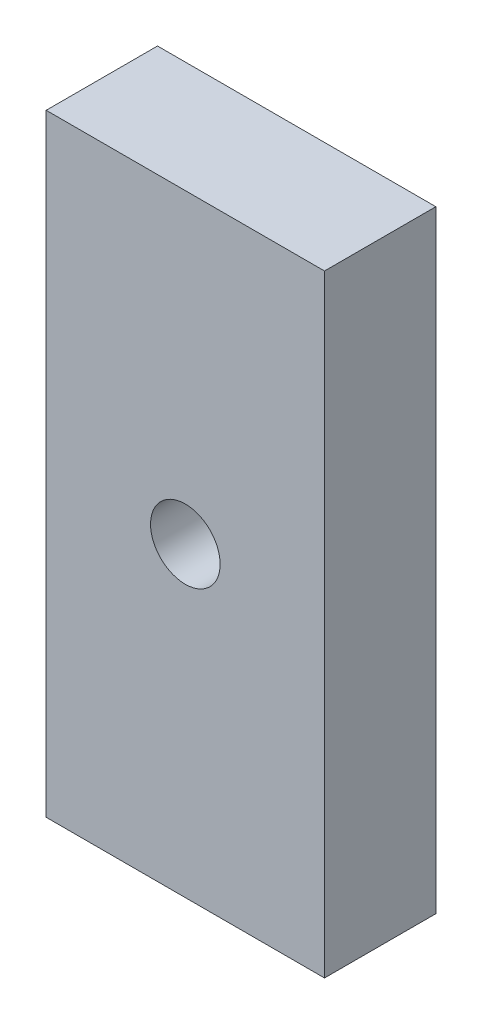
ISO-10303-21;
HEADER;
FILE_DESCRIPTION(('STEP AP214'),'2;1');
FILE_NAME('part.step','',(''),(''),'','','');
FILE_SCHEMA(('AUTOMOTIVE_DESIGN { 1 0 10303 214 1 1 1 1 }'));
ENDSEC;
DATA;
#1=APPLICATION_CONTEXT('core data for automotive mechanical design processes');
#2=APPLICATION_PROTOCOL_DEFINITION('international standard','automotive_design',2000,#1);
#3=PRODUCT_CONTEXT('',#1,'mechanical');
#4=PRODUCT('Part','Part','',(#3));
#5=PRODUCT_RELATED_PRODUCT_CATEGORY('part','',(#4));
#6=PRODUCT_DEFINITION_FORMATION('','',#4);
#7=PRODUCT_DEFINITION_CONTEXT('part definition',#1,'design');
#8=PRODUCT_DEFINITION('design','',#6,#7);
#9=PRODUCT_DEFINITION_SHAPE('','',#8);
#10=(LENGTH_UNIT() NAMED_UNIT(*) SI_UNIT(.MILLI.,.METRE.));
#11=(NAMED_UNIT(*) PLANE_ANGLE_UNIT() SI_UNIT($,.RADIAN.));
#12=(NAMED_UNIT(*) SI_UNIT($,.STERADIAN.) SOLID_ANGLE_UNIT());
#13=UNCERTAINTY_MEASURE_WITH_UNIT(LENGTH_MEASURE(1.E-05),#10,'distance_accuracy_value','');
#14=(GEOMETRIC_REPRESENTATION_CONTEXT(3) GLOBAL_UNCERTAINTY_ASSIGNED_CONTEXT((#13)) GLOBAL_UNIT_ASSIGNED_CONTEXT((#10,
#11,#12)) REPRESENTATION_CONTEXT('',''));
#15=CARTESIAN_POINT('',(0.,0.,0.));
#16=DIRECTION('',(0.,0.,1.));
#17=DIRECTION('',(1.,0.,0.));
#18=AXIS2_PLACEMENT_3D('',#15,#16,#17);
#19=CARTESIAN_POINT('',(0.,0.,0.));
#20=DIRECTION('',(0.,0.,1.));
#21=DIRECTION('',(0.,-1.,0.));
#22=AXIS2_PLACEMENT_3D('',#19,#20,#21);
#23=PLANE('',#22);
#24=CARTESIAN_POINT('',(0.,0.,0.));
#25=DIRECTION('',(0.,0.,1.));
#26=DIRECTION('',(0.,-1.,0.));
#27=AXIS2_PLACEMENT_3D('',#24,#25,#26);
#28=CIRCLE('',#27,2.5);
#29=CARTESIAN_POINT('',(0.,-2.5,0.));
#30=VERTEX_POINT('',#29);
#31=EDGE_CURVE('E68',#30,#30,#28,.T.);
#32=ORIENTED_EDGE('',*,*,#31,.T.);
#33=EDGE_LOOP('',(#32));
#34=FACE_BOUND('',#33,.T.);
#35=DIRECTION('',(1.,0.,0.));
#36=VECTOR('',#35,1.);
#37=CARTESIAN_POINT('',(-10.,22.,0.));
#38=LINE('',#37,#36);
#39=CARTESIAN_POINT('',(10.,22.,0.));
#40=VERTEX_POINT('',#39);
#41=CARTESIAN_POINT('',(-10.,22.,0.));
#42=VERTEX_POINT('',#41);
#43=EDGE_CURVE('E18',#40,#42,#38,.F.);
#44=ORIENTED_EDGE('',*,*,#43,.F.);
#45=DIRECTION('',(0.,-1.,0.));
#46=VECTOR('',#45,1.);
#47=CARTESIAN_POINT('',(10.,22.,0.));
#48=LINE('',#47,#46);
#49=CARTESIAN_POINT('',(10.,-22.,0.));
#50=VERTEX_POINT('',#49);
#51=EDGE_CURVE('E87',#50,#40,#48,.F.);
#52=ORIENTED_EDGE('',*,*,#51,.F.);
#53=DIRECTION('',(1.,0.,0.));
#54=VECTOR('',#53,1.);
#55=CARTESIAN_POINT('',(10.,-22.,0.));
#56=LINE('',#55,#54);
#57=CARTESIAN_POINT('',(-10.,-22.,0.));
#58=VERTEX_POINT('',#57);
#59=EDGE_CURVE('E69',#58,#50,#56,.T.);
#60=ORIENTED_EDGE('',*,*,#59,.F.);
#61=DIRECTION('',(0.,-1.,0.));
#62=VECTOR('',#61,1.);
#63=CARTESIAN_POINT('',(-10.,-22.,0.));
#64=LINE('',#63,#62);
#65=EDGE_CURVE('E54',#42,#58,#64,.T.);
#66=ORIENTED_EDGE('',*,*,#65,.F.);
#67=EDGE_LOOP('',(#44,#52,#60,#66));
#68=FACE_BOUND('',#67,.T.);
#69=ADVANCED_FACE('F15',(#34,#68),#23,.F.);
#70=CARTESIAN_POINT('',(-10.,22.,0.));
#71=DIRECTION('',(0.,1.,0.));
#72=DIRECTION('',(0.,0.,1.));
#73=AXIS2_PLACEMENT_3D('',#70,#71,#72);
#74=PLANE('',#73);
#75=ORIENTED_EDGE('',*,*,#43,.T.);
#76=DIRECTION('',(0.,0.,-1.));
#77=VECTOR('',#76,1.);
#78=CARTESIAN_POINT('',(-10.,22.,0.));
#79=LINE('',#78,#77);
#80=CARTESIAN_POINT('',(-10.,22.,8.));
#81=VERTEX_POINT('',#80);
#82=EDGE_CURVE('E60',#81,#42,#79,.T.);
#83=ORIENTED_EDGE('',*,*,#82,.F.);
#84=DIRECTION('',(1.,0.,0.));
#85=VECTOR('',#84,1.);
#86=CARTESIAN_POINT('',(0.,22.,8.));
#87=LINE('',#86,#85);
#88=CARTESIAN_POINT('',(10.,22.,8.));
#89=VERTEX_POINT('',#88);
#90=EDGE_CURVE('E92',#89,#81,#87,.F.);
#91=ORIENTED_EDGE('',*,*,#90,.F.);
#92=DIRECTION('',(0.,0.,1.));
#93=VECTOR('',#92,1.);
#94=CARTESIAN_POINT('',(10.,22.,0.));
#95=LINE('',#94,#93);
#96=EDGE_CURVE('E63',#40,#89,#95,.T.);
#97=ORIENTED_EDGE('',*,*,#96,.F.);
#98=EDGE_LOOP('',(#75,#83,#91,#97));
#99=FACE_BOUND('',#98,.T.);
#100=ADVANCED_FACE('F59',(#99),#74,.T.);
#101=CARTESIAN_POINT('',(-10.,-22.,0.));
#102=DIRECTION('',(-1.,0.,0.));
#103=DIRECTION('',(0.,0.,-1.));
#104=AXIS2_PLACEMENT_3D('',#101,#102,#103);
#105=PLANE('',#104);
#106=ORIENTED_EDGE('',*,*,#65,.T.);
#107=DIRECTION('',(0.,0.,-1.));
#108=VECTOR('',#107,1.);
#109=CARTESIAN_POINT('',(-10.,-22.,0.));
#110=LINE('',#109,#108);
#111=CARTESIAN_POINT('',(-10.,-22.,8.));
#112=VERTEX_POINT('',#111);
#113=EDGE_CURVE('E72',#112,#58,#110,.T.);
#114=ORIENTED_EDGE('',*,*,#113,.F.);
#115=DIRECTION('',(0.,-1.,0.));
#116=VECTOR('',#115,1.);
#117=CARTESIAN_POINT('',(-10.,0.,8.));
#118=LINE('',#117,#116);
#119=EDGE_CURVE('E76',#81,#112,#118,.T.);
#120=ORIENTED_EDGE('',*,*,#119,.F.);
#121=ORIENTED_EDGE('',*,*,#82,.T.);
#122=EDGE_LOOP('',(#106,#114,#120,#121));
#123=FACE_BOUND('',#122,.T.);
#124=ADVANCED_FACE('F74',(#123),#105,.T.);
#125=CARTESIAN_POINT('',(10.,-22.,0.));
#126=DIRECTION('',(0.,-1.,0.));
#127=DIRECTION('',(0.,0.,-1.));
#128=AXIS2_PLACEMENT_3D('',#125,#126,#127);
#129=PLANE('',#128);
#130=ORIENTED_EDGE('',*,*,#59,.T.);
#131=DIRECTION('',(0.,0.,1.));
#132=VECTOR('',#131,1.);
#133=CARTESIAN_POINT('',(10.,-22.,0.));
#134=LINE('',#133,#132);
#135=CARTESIAN_POINT('',(10.,-22.,8.));
#136=VERTEX_POINT('',#135);
#137=EDGE_CURVE('E34',#136,#50,#134,.F.);
#138=ORIENTED_EDGE('',*,*,#137,.F.);
#139=DIRECTION('',(1.,0.,0.));
#140=VECTOR('',#139,1.);
#141=CARTESIAN_POINT('',(0.,-22.,8.));
#142=LINE('',#141,#140);
#143=EDGE_CURVE('E25',#112,#136,#142,.T.);
#144=ORIENTED_EDGE('',*,*,#143,.F.);
#145=ORIENTED_EDGE('',*,*,#113,.T.);
#146=EDGE_LOOP('',(#130,#138,#144,#145));
#147=FACE_BOUND('',#146,.T.);
#148=ADVANCED_FACE('F120',(#147),#129,.T.);
#149=CARTESIAN_POINT('',(10.,22.,0.));
#150=DIRECTION('',(1.,0.,0.));
#151=DIRECTION('',(0.,0.,1.));
#152=AXIS2_PLACEMENT_3D('',#149,#150,#151);
#153=PLANE('',#152);
#154=ORIENTED_EDGE('',*,*,#51,.T.);
#155=ORIENTED_EDGE('',*,*,#96,.T.);
#156=DIRECTION('',(0.,-1.,0.));
#157=VECTOR('',#156,1.);
#158=CARTESIAN_POINT('',(10.,0.,8.));
#159=LINE('',#158,#157);
#160=EDGE_CURVE('E9',#136,#89,#159,.F.);
#161=ORIENTED_EDGE('',*,*,#160,.F.);
#162=ORIENTED_EDGE('',*,*,#137,.T.);
#163=EDGE_LOOP('',(#154,#155,#161,#162));
#164=FACE_BOUND('',#163,.T.);
#165=ADVANCED_FACE('F118',(#164),#153,.T.);
#166=CARTESIAN_POINT('',(0.,0.,8.));
#167=DIRECTION('',(0.,0.,1.));
#168=DIRECTION('',(0.,-1.,0.));
#169=AXIS2_PLACEMENT_3D('',#166,#167,#168);
#170=PLANE('',#169);
#171=CARTESIAN_POINT('',(0.,0.,8.));
#172=DIRECTION('',(0.,0.,1.));
#173=DIRECTION('',(0.,-1.,0.));
#174=AXIS2_PLACEMENT_3D('',#171,#172,#173);
#175=CIRCLE('',#174,2.5);
#176=CARTESIAN_POINT('',(0.,-2.5,8.));
#177=VERTEX_POINT('',#176);
#178=EDGE_CURVE('E100',#177,#177,#175,.T.);
#179=ORIENTED_EDGE('',*,*,#178,.F.);
#180=EDGE_LOOP('',(#179));
#181=FACE_BOUND('',#180,.T.);
#182=ORIENTED_EDGE('',*,*,#143,.T.);
#183=ORIENTED_EDGE('',*,*,#160,.T.);
#184=ORIENTED_EDGE('',*,*,#90,.T.);
#185=ORIENTED_EDGE('',*,*,#119,.T.);
#186=EDGE_LOOP('',(#182,#183,#184,#185));
#187=FACE_BOUND('',#186,.T.);
#188=ADVANCED_FACE('F112',(#181,#187),#170,.T.);
#189=CARTESIAN_POINT('',(0.,0.,0.));
#190=DIRECTION('',(0.,0.,1.));
#191=DIRECTION('',(0.,-1.,0.));
#192=AXIS2_PLACEMENT_3D('',#189,#190,#191);
#193=CYLINDRICAL_SURFACE('',#192,2.5);
#194=ORIENTED_EDGE('',*,*,#31,.F.);
#195=EDGE_LOOP('',(#194));
#196=FACE_BOUND('',#195,.T.);
#197=ORIENTED_EDGE('',*,*,#178,.T.);
#198=EDGE_LOOP('',(#197));
#199=FACE_BOUND('',#198,.T.);
#200=ADVANCED_FACE('F109',(#196,#199),#193,.F.);
#201=CLOSED_SHELL('',(#69,#100,#124,#148,#165,#188,#200));
#202=MANIFOLD_SOLID_BREP('B1',#201);
#203=ADVANCED_BREP_SHAPE_REPRESENTATION('',(#18,#202),#14);
#204=SHAPE_DEFINITION_REPRESENTATION(#9,#203);
ENDSEC;
END-ISO-10303-21;
